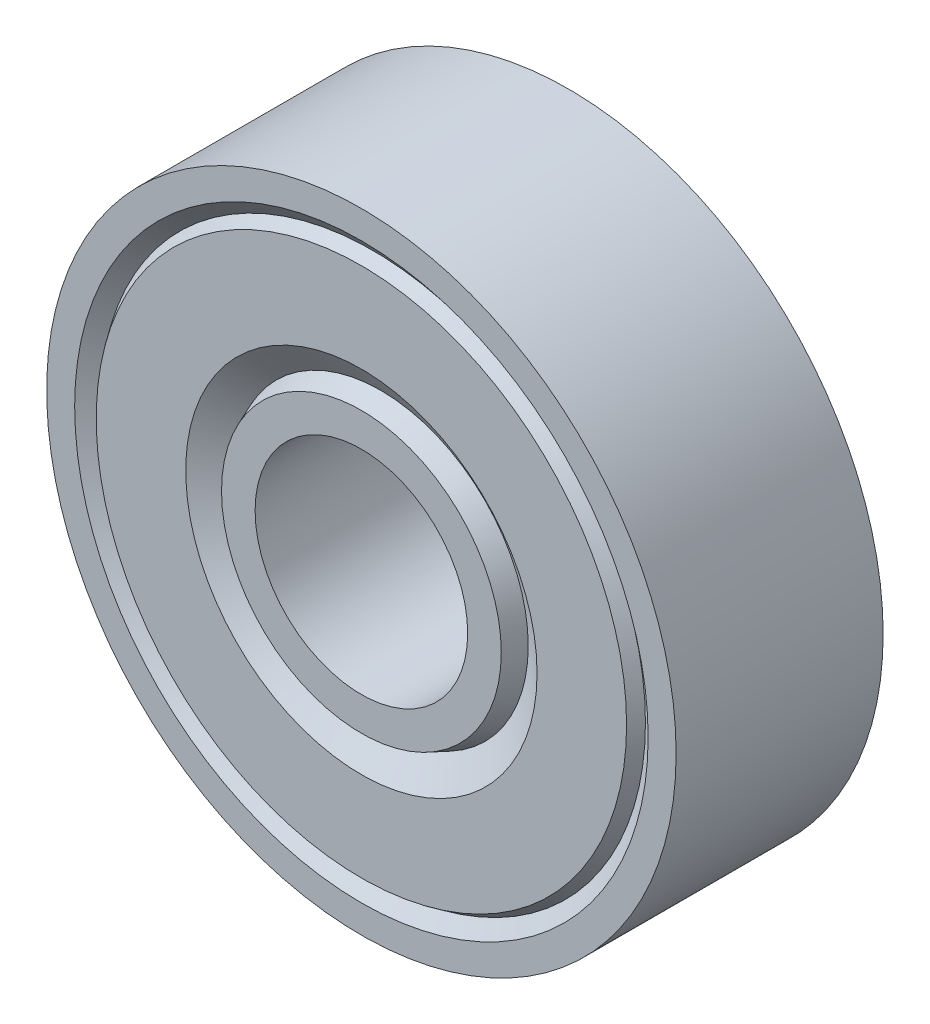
from build123d import *


with BuildPart() as part:
    # Sketch1 → Revolve1 (revolve)
    with BuildSketch(Plane(origin=(0, 0, 0), x_dir=(1, 0, 0), z_dir=(0, 1, 0)), mode=Mode.PRIVATE) as revolve1_sk:
        Polygon((-6.35, 4.698999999), (-4.825999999, 4.698999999), (-4.825999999, -4.698999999), (-6.35, -4.698999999), (-6.701362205, -3.825839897), (-7.974672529, -4.698999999), (-12.038672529, -4.698999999), (-12.387028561, -4.190999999), (-13.0175, -4.698999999), (-14.2875, -4.698999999), (-14.2875, 4.698999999), (-13.0175, 4.698999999), (-12.387028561, 4.190999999), (-12.038672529, 4.698999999), (-7.974672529, 4.698999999), (-6.701362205, 3.825839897), align=None)
    revolve(revolve1_sk.sketch.rotate(Axis((0, 0, 0), (0, 0, -1)), 180), axis=Axis((0, 0, 0), (0, 0, -1)))


solid = part.part
